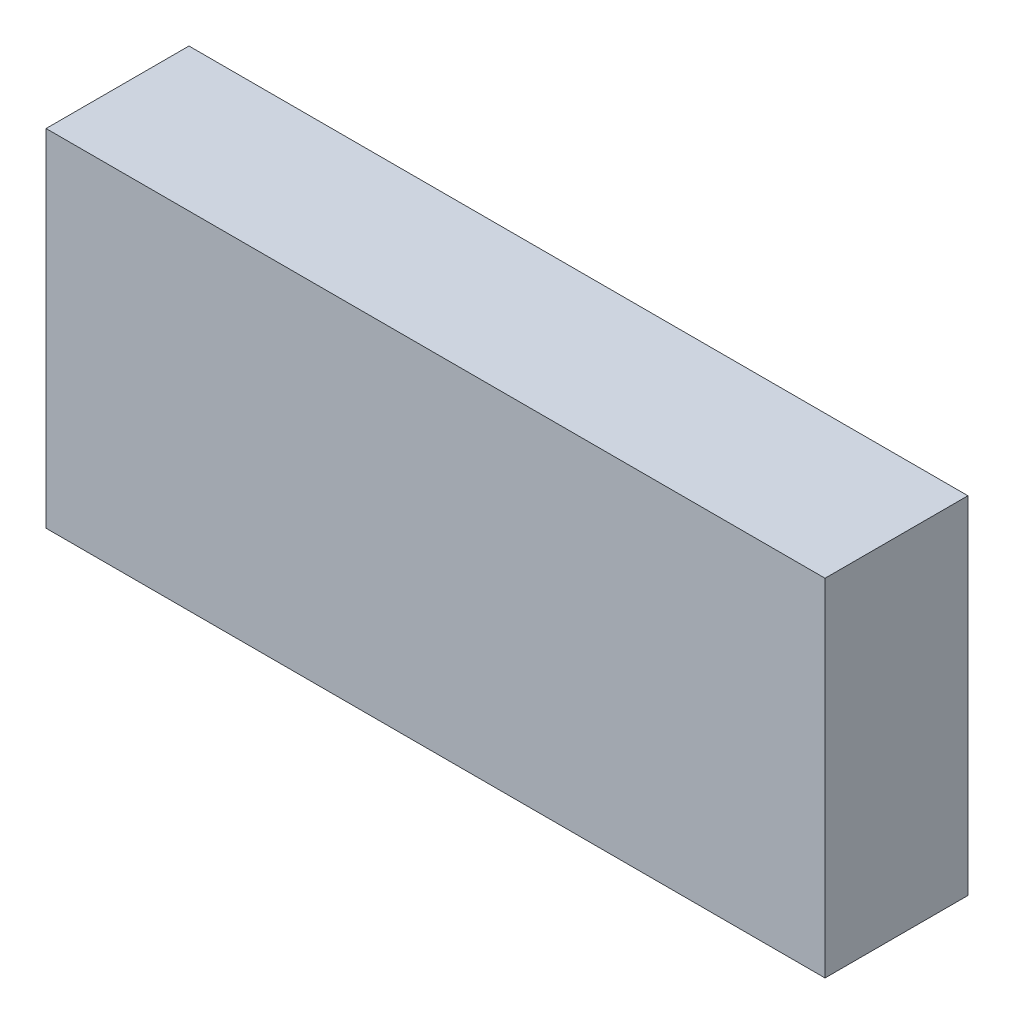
ISO-10303-21;
HEADER;
FILE_DESCRIPTION(('STEP AP214'),'2;1');
FILE_NAME('part.step','',(''),(''),'','','');
FILE_SCHEMA(('AUTOMOTIVE_DESIGN { 1 0 10303 214 1 1 1 1 }'));
ENDSEC;
DATA;
#1=APPLICATION_CONTEXT('core data for automotive mechanical design processes');
#2=APPLICATION_PROTOCOL_DEFINITION('international standard','automotive_design',2000,#1);
#3=PRODUCT_CONTEXT('',#1,'mechanical');
#4=PRODUCT('Part','Part','',(#3));
#5=PRODUCT_RELATED_PRODUCT_CATEGORY('part','',(#4));
#6=PRODUCT_DEFINITION_FORMATION('','',#4);
#7=PRODUCT_DEFINITION_CONTEXT('part definition',#1,'design');
#8=PRODUCT_DEFINITION('design','',#6,#7);
#9=PRODUCT_DEFINITION_SHAPE('','',#8);
#10=(LENGTH_UNIT() NAMED_UNIT(*) SI_UNIT(.MILLI.,.METRE.));
#11=(NAMED_UNIT(*) PLANE_ANGLE_UNIT() SI_UNIT($,.RADIAN.));
#12=(NAMED_UNIT(*) SI_UNIT($,.STERADIAN.) SOLID_ANGLE_UNIT());
#13=UNCERTAINTY_MEASURE_WITH_UNIT(LENGTH_MEASURE(1.E-05),#10,'distance_accuracy_value','');
#14=(GEOMETRIC_REPRESENTATION_CONTEXT(3) GLOBAL_UNCERTAINTY_ASSIGNED_CONTEXT((#13)) GLOBAL_UNIT_ASSIGNED_CONTEXT((#10,
#11,#12)) REPRESENTATION_CONTEXT('',''));
#15=CARTESIAN_POINT('',(0.,0.,0.));
#16=DIRECTION('',(0.,0.,1.));
#17=DIRECTION('',(1.,0.,0.));
#18=AXIS2_PLACEMENT_3D('',#15,#16,#17);
#19=CARTESIAN_POINT('',(-0.9,-0.4,0.3302));
#20=DIRECTION('',(1.,0.,0.));
#21=DIRECTION('',(0.,0.,-1.));
#22=AXIS2_PLACEMENT_3D('',#19,#20,#21);
#23=PLANE('',#22);
#24=DIRECTION('',(0.,-1.,0.));
#25=VECTOR('',#24,1.);
#26=CARTESIAN_POINT('',(-0.9,-0.4,0.));
#27=LINE('',#26,#25);
#28=CARTESIAN_POINT('',(-0.9,0.4,0.));
#29=VERTEX_POINT('',#28);
#30=CARTESIAN_POINT('',(-0.9,-0.4,0.));
#31=VERTEX_POINT('',#30);
#32=EDGE_CURVE('E95',#29,#31,#27,.T.);
#33=ORIENTED_EDGE('',*,*,#32,.T.);
#34=DIRECTION('',(0.,0.,-1.));
#35=VECTOR('',#34,1.);
#36=CARTESIAN_POINT('',(-0.9,-0.4,0.3302));
#37=LINE('',#36,#35);
#38=CARTESIAN_POINT('',(-0.9,-0.4,0.3302));
#39=VERTEX_POINT('',#38);
#40=EDGE_CURVE('E11',#39,#31,#37,.T.);
#41=ORIENTED_EDGE('',*,*,#40,.F.);
#42=DIRECTION('',(0.,-1.,0.));
#43=VECTOR('',#42,1.);
#44=CARTESIAN_POINT('',(-0.9,-0.4,0.3302));
#45=LINE('',#44,#43);
#46=CARTESIAN_POINT('',(-0.9,0.4,0.3302));
#47=VERTEX_POINT('',#46);
#48=EDGE_CURVE('E83',#47,#39,#45,.T.);
#49=ORIENTED_EDGE('',*,*,#48,.F.);
#50=DIRECTION('',(0.,0.,-1.));
#51=VECTOR('',#50,1.);
#52=CARTESIAN_POINT('',(-0.9,0.4,0.3302));
#53=LINE('',#52,#51);
#54=EDGE_CURVE('E91',#47,#29,#53,.T.);
#55=ORIENTED_EDGE('',*,*,#54,.T.);
#56=EDGE_LOOP('',(#33,#41,#49,#55));
#57=FACE_BOUND('',#56,.T.);
#58=ADVANCED_FACE('F32',(#57),#23,.F.);
#59=CARTESIAN_POINT('',(0.9,-0.4,0.3302));
#60=DIRECTION('',(0.,1.,0.));
#61=DIRECTION('',(0.,0.,1.));
#62=AXIS2_PLACEMENT_3D('',#59,#60,#61);
#63=PLANE('',#62);
#64=DIRECTION('',(1.,0.,0.));
#65=VECTOR('',#64,1.);
#66=CARTESIAN_POINT('',(0.9,-0.4,0.));
#67=LINE('',#66,#65);
#68=CARTESIAN_POINT('',(0.9,-0.4,0.));
#69=VERTEX_POINT('',#68);
#70=EDGE_CURVE('E87',#31,#69,#67,.T.);
#71=ORIENTED_EDGE('',*,*,#70,.T.);
#72=DIRECTION('',(0.,0.,-1.));
#73=VECTOR('',#72,1.);
#74=CARTESIAN_POINT('',(0.9,-0.4,0.3302));
#75=LINE('',#74,#73);
#76=CARTESIAN_POINT('',(0.9,-0.4,0.3302));
#77=VERTEX_POINT('',#76);
#78=EDGE_CURVE('E40',#77,#69,#75,.T.);
#79=ORIENTED_EDGE('',*,*,#78,.F.);
#80=DIRECTION('',(1.,0.,0.));
#81=VECTOR('',#80,1.);
#82=CARTESIAN_POINT('',(0.9,-0.4,0.3302));
#83=LINE('',#82,#81);
#84=EDGE_CURVE('E78',#39,#77,#83,.T.);
#85=ORIENTED_EDGE('',*,*,#84,.F.);
#86=ORIENTED_EDGE('',*,*,#40,.T.);
#87=EDGE_LOOP('',(#71,#79,#85,#86));
#88=FACE_BOUND('',#87,.T.);
#89=ADVANCED_FACE('F86',(#88),#63,.F.);
#90=CARTESIAN_POINT('',(0.9,0.4,0.3302));
#91=DIRECTION('',(-1.,0.,0.));
#92=DIRECTION('',(0.,0.,1.));
#93=AXIS2_PLACEMENT_3D('',#90,#91,#92);
#94=PLANE('',#93);
#95=DIRECTION('',(0.,1.,0.));
#96=VECTOR('',#95,1.);
#97=CARTESIAN_POINT('',(0.9,0.4,0.));
#98=LINE('',#97,#96);
#99=CARTESIAN_POINT('',(0.9,0.4,0.));
#100=VERTEX_POINT('',#99);
#101=EDGE_CURVE('E65',#69,#100,#98,.T.);
#102=ORIENTED_EDGE('',*,*,#101,.T.);
#103=DIRECTION('',(0.,0.,-1.));
#104=VECTOR('',#103,1.);
#105=CARTESIAN_POINT('',(0.9,0.4,0.3302));
#106=LINE('',#105,#104);
#107=CARTESIAN_POINT('',(0.9,0.4,0.3302));
#108=VERTEX_POINT('',#107);
#109=EDGE_CURVE('E88',#108,#100,#106,.T.);
#110=ORIENTED_EDGE('',*,*,#109,.F.);
#111=DIRECTION('',(0.,1.,0.));
#112=VECTOR('',#111,1.);
#113=CARTESIAN_POINT('',(0.9,0.4,0.3302));
#114=LINE('',#113,#112);
#115=EDGE_CURVE('E81',#77,#108,#114,.T.);
#116=ORIENTED_EDGE('',*,*,#115,.F.);
#117=ORIENTED_EDGE('',*,*,#78,.T.);
#118=EDGE_LOOP('',(#102,#110,#116,#117));
#119=FACE_BOUND('',#118,.T.);
#120=ADVANCED_FACE('F89',(#119),#94,.F.);
#121=CARTESIAN_POINT('',(-0.9,0.4,0.3302));
#122=DIRECTION('',(0.,-1.,0.));
#123=DIRECTION('',(0.,0.,-1.));
#124=AXIS2_PLACEMENT_3D('',#121,#122,#123);
#125=PLANE('',#124);
#126=DIRECTION('',(-1.,0.,0.));
#127=VECTOR('',#126,1.);
#128=CARTESIAN_POINT('',(-0.9,0.4,0.));
#129=LINE('',#128,#127);
#130=EDGE_CURVE('E71',#100,#29,#129,.T.);
#131=ORIENTED_EDGE('',*,*,#130,.T.);
#132=ORIENTED_EDGE('',*,*,#54,.F.);
#133=DIRECTION('',(-1.,0.,0.));
#134=VECTOR('',#133,1.);
#135=CARTESIAN_POINT('',(-0.9,0.4,0.3302));
#136=LINE('',#135,#134);
#137=EDGE_CURVE('E48',#108,#47,#136,.T.);
#138=ORIENTED_EDGE('',*,*,#137,.F.);
#139=ORIENTED_EDGE('',*,*,#109,.T.);
#140=EDGE_LOOP('',(#131,#132,#138,#139));
#141=FACE_BOUND('',#140,.T.);
#142=ADVANCED_FACE('F102',(#141),#125,.F.);
#143=CARTESIAN_POINT('',(0.,0.,0.3302));
#144=DIRECTION('',(0.,0.,-1.));
#145=DIRECTION('',(-1.,0.,0.));
#146=AXIS2_PLACEMENT_3D('',#143,#144,#145);
#147=PLANE('',#146);
#148=ORIENTED_EDGE('',*,*,#48,.T.);
#149=ORIENTED_EDGE('',*,*,#84,.T.);
#150=ORIENTED_EDGE('',*,*,#115,.T.);
#151=ORIENTED_EDGE('',*,*,#137,.T.);
#152=EDGE_LOOP('',(#148,#149,#150,#151));
#153=FACE_BOUND('',#152,.T.);
#154=ADVANCED_FACE('F79',(#153),#147,.F.);
#155=CARTESIAN_POINT('',(0.,0.,0.));
#156=DIRECTION('',(0.,0.,-1.));
#157=DIRECTION('',(-1.,0.,0.));
#158=AXIS2_PLACEMENT_3D('',#155,#156,#157);
#159=PLANE('',#158);
#160=ORIENTED_EDGE('',*,*,#32,.F.);
#161=ORIENTED_EDGE('',*,*,#130,.F.);
#162=ORIENTED_EDGE('',*,*,#101,.F.);
#163=ORIENTED_EDGE('',*,*,#70,.F.);
#164=EDGE_LOOP('',(#160,#161,#162,#163));
#165=FACE_BOUND('',#164,.T.);
#166=ADVANCED_FACE('F105',(#165),#159,.T.);
#167=CLOSED_SHELL('',(#58,#89,#120,#142,#154,#166));
#168=MANIFOLD_SOLID_BREP('B2',#167);
#169=ADVANCED_BREP_SHAPE_REPRESENTATION('',(#18,#168),#14);
#170=SHAPE_DEFINITION_REPRESENTATION(#9,#169);
ENDSEC;
END-ISO-10303-21;
